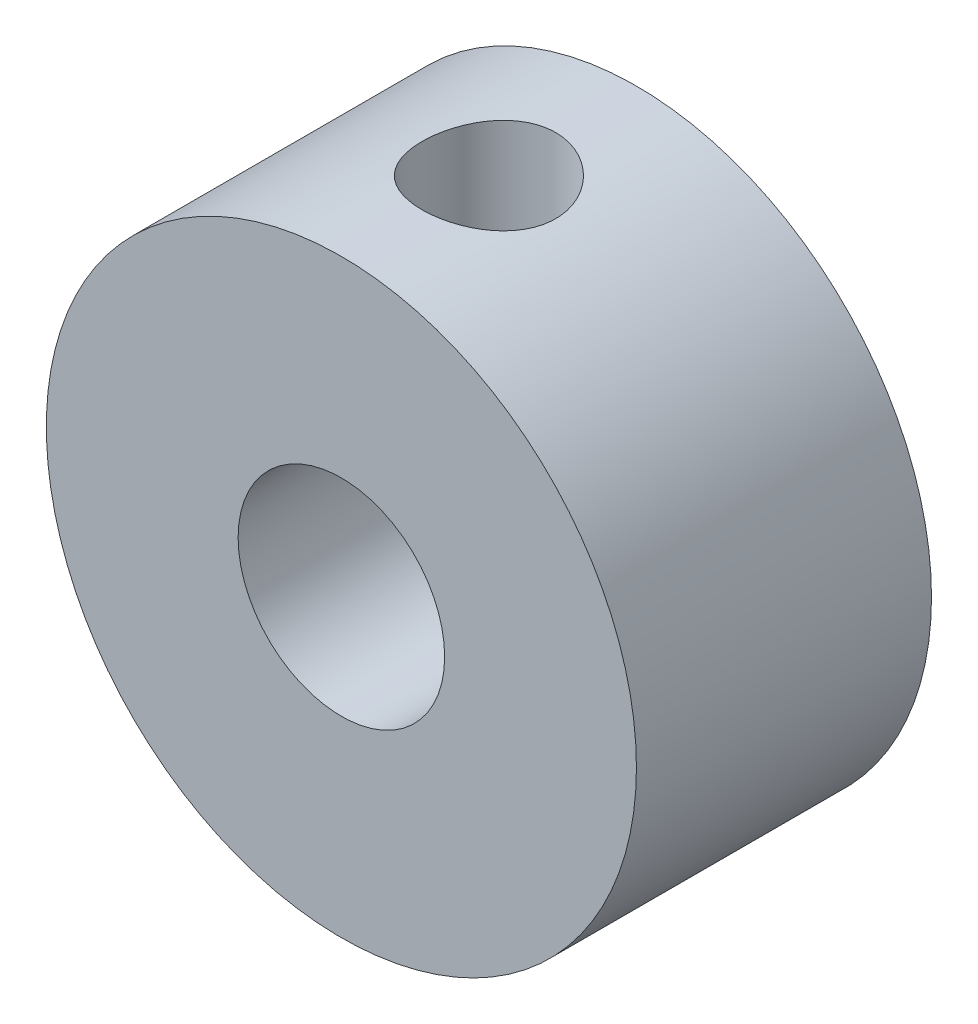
from build123d import *

# Parameters (mm, degrees)
ESQUISSE1_R           = 15
ESQUISSE1_R_2         = 5.25
EXTRUSION1_DEPTH      = 7.5
TROU_TARAUD_M81_D     = 6.8
TROU_TARAUD_M81_DEPTH = 17
TROU_TARAUD_M81_TIP   = 2.042926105


with BuildPart() as part:
    # Esquisse1 → Extrusion1 (new, symmetric)
    with BuildSketch(Plane.XY):
        Circle(ESQUISSE1_R)
        Circle(ESQUISSE1_R_2, mode=Mode.SUBTRACT)
    extrude(amount=EXTRUSION1_DEPTH, both=True)

    # Trou taraud_ M81
    with Locations(Plane(origin=(0, 15, 0), x_dir=(-1, 0, 0), z_dir=(0, 1, 0))):
        with Locations((0, 0)):
            Hole(TROU_TARAUD_M81_D / 2, depth=TROU_TARAUD_M81_DEPTH)
            with Locations((0, 0, -(TROU_TARAUD_M81_DEPTH + TROU_TARAUD_M81_TIP / 2))):  # 118° drill point
                Cone(0, TROU_TARAUD_M81_D / 2, TROU_TARAUD_M81_TIP, mode=Mode.SUBTRACT)


solid = part.part
